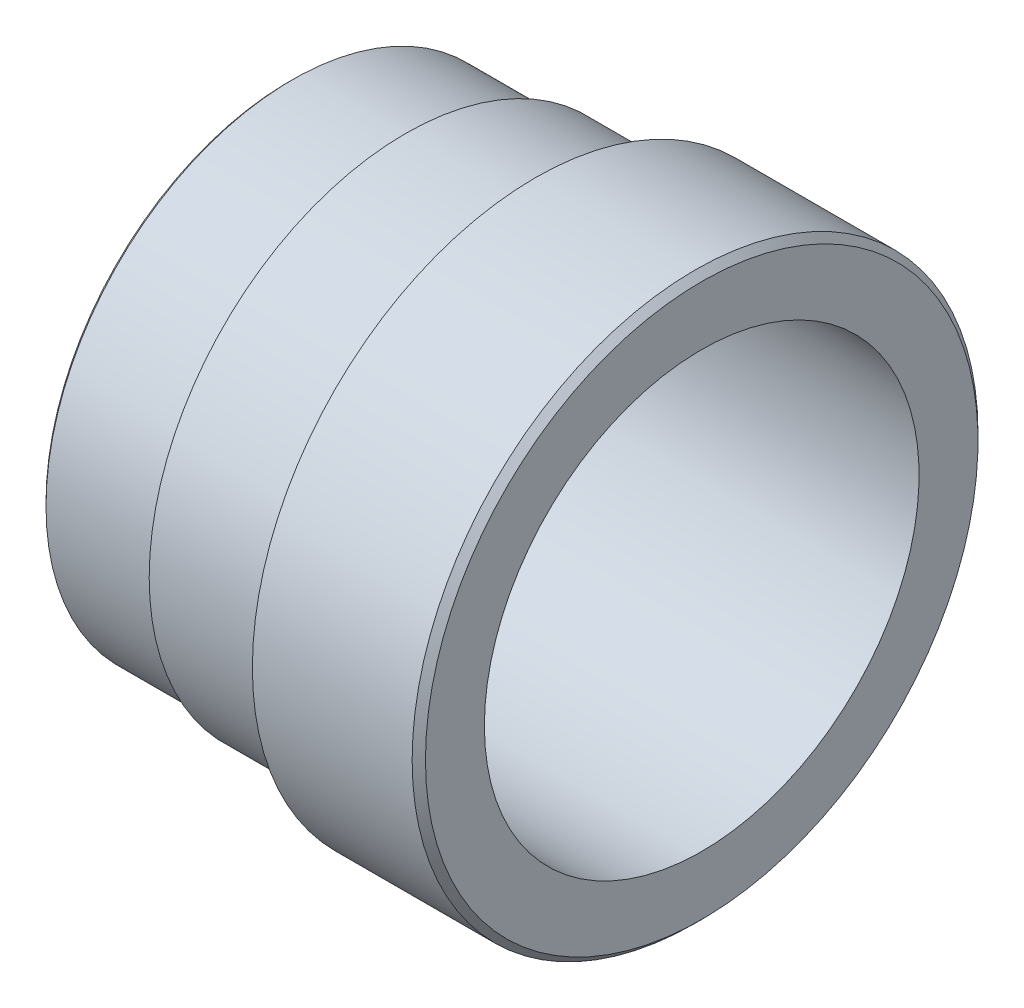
from build123d import *


with BuildPart() as part:
    # Esquisse1 → R_volution1 (revolve)
    with BuildSketch(Plane.XY, mode=Mode.PRIVATE) as r_volution1_sk:
        with BuildLine():
            Line((0, 65.3), (0, 83))
            Line((0, 83), (-2, 85))
            Line((-2, 85), (-50, 85))
            Line((-50, 85), (-50, 79))
            ThreePointArc((-50, 79), (-50.585786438, 77.585786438), (-52, 77))
            Line((-52, 77), (-89, 77))
            Line((-89, 77), (-89, 74))
            Line((-89, 74), (-123, 74))
            Line((-123, 74), (-124, 73))
            Line((-124, 73), (-124, 65.3))
            Line((-124, 65.3), (0, 65.3))
        make_face()
    revolve(r_volution1_sk.sketch.rotate(Axis((-124, 0, 0), (1, 0, 0)), 90), axis=Axis((-124, 0, 0), (1, 0, 0)))


solid = part.part
